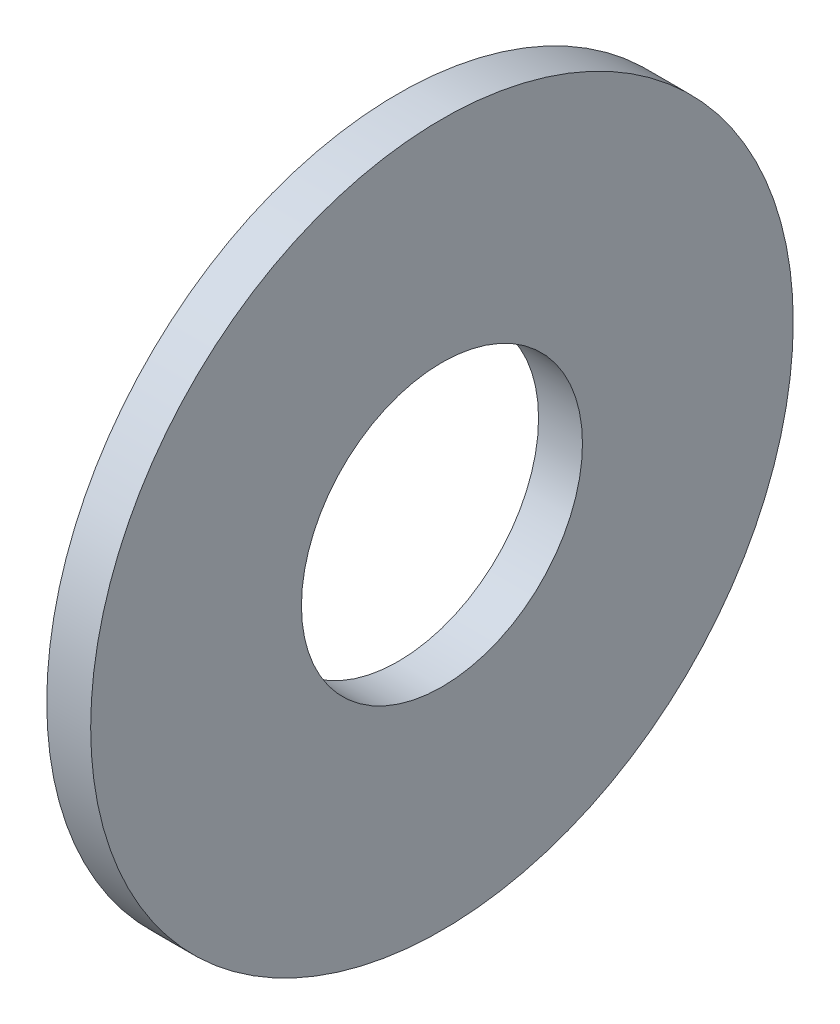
from build123d import *

# Parameters (mm, degrees)
SKETCH1_R          = 4
SKETCH1_R_2        = 1.6
BASE_EXTRUDE_DEPTH = 0.5


with BuildPart() as part:
    # Sketch1 → Base-Extrude (new body)
    with BuildSketch(Plane(origin=(0, 0, 0), x_dir=(0, 0, -1), z_dir=(1, 0, 0))):
        Circle(SKETCH1_R)
        Circle(SKETCH1_R_2, mode=Mode.SUBTRACT)
    extrude(amount=BASE_EXTRUDE_DEPTH)


solid = part.part
